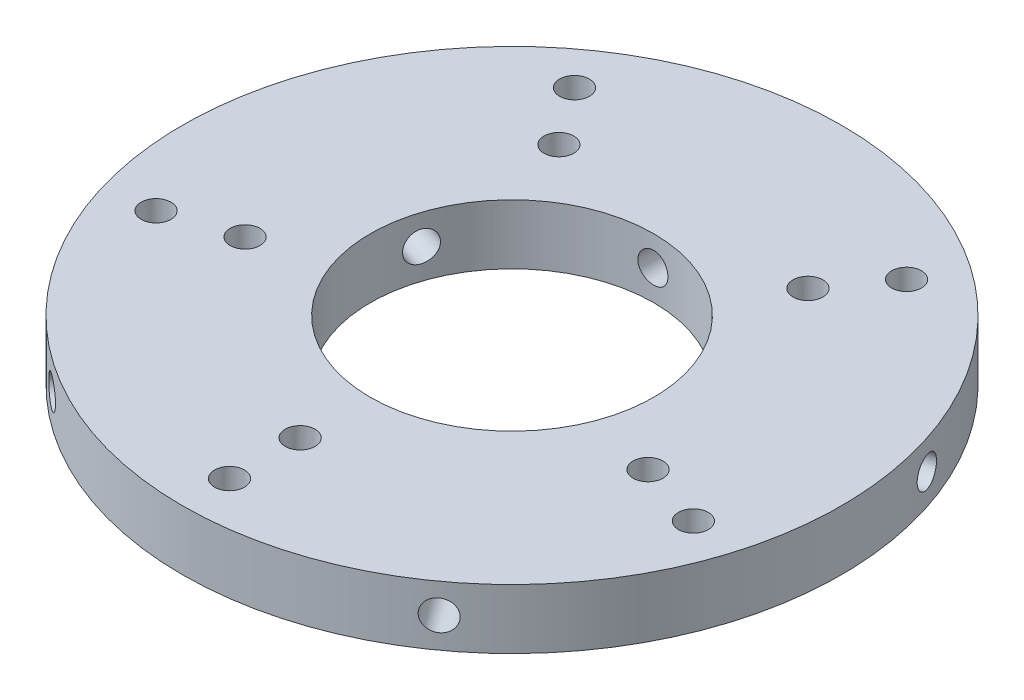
from build123d import *

# Parameters (mm, degrees)
CROQUIS1_R                 = 70
CROQUIS1_R_2               = 30.1
EXTRUIR1_DEPTH             = 12.7
CORTAR_EXTRUIR1_REACH      = 101.806
CORTAR_EXTRUIR1_END_RADIUS = 70
CROQUIS2_R                 = 3.2
MATRIZC1_COUNT             = 5
CORTAR_EXTRUIR2_REACH      = 101.806
CROQUIS4_R                 = 3.175
MATRIZC2_COUNT             = 5


with BuildPart() as part:
    # Croquis1 → Extruir1 (new body)
    with BuildSketch(Plane(origin=(0, 0, 0), x_dir=(1, 0, 0), z_dir=(0, 1, 0))):
        with Locations(Location((0, 0, 0), (0, 0, 270))):
            Circle(CROQUIS1_R)
        with Locations(Location((0, 0, 0), (0, 0, 270))):
            Circle(CROQUIS1_R_2, mode=Mode.SUBTRACT)
    extrude(amount=EXTRUIR1_DEPTH)

    # Cortar-Extruir1: up to this cylinder (the profile starts inside it)
    cortar_extruir1_end = Plane(origin=(0, 6.428835, 0), z_dir=(0, -1, 0)) * Cylinder(CORTAR_EXTRUIR1_END_RADIUS, 344.612, mode=Mode.PRIVATE)
    # Croquis2 → Cortar-Extruir1 (cut, up to the surface)
    with BuildSketch(Plane.XY, mode=Mode.PRIVATE) as cortar_extruir1_sk1:
        with Locations((0, 6.428835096)):
            Circle(CROQUIS2_R)
    cortar_extruir1_tool1 = extrude(cortar_extruir1_sk1.sketch, amount=-CORTAR_EXTRUIR1_REACH, mode=Mode.PRIVATE) & cortar_extruir1_end
    cortar_extruir1 = cortar_extruir1_tool1.solids().sort_by_distance((0, 6.428835, 0))[0]
    add(cortar_extruir1, mode=Mode.SUBTRACT)

    # MatrizC1: Cortar-Extruir1 ×5 about axis
    matrizc1_axis = Axis((0, 13.54995958, 0), (0, -1, 0))
    for i in range(1, MATRIZC1_COUNT):
        add(cortar_extruir1.rotate(matrizc1_axis, i * 360 / MATRIZC1_COUNT), mode=Mode.SUBTRACT)

    # Croquis4 → Cortar-Extruir2 (cut, up to next)
    with BuildSketch(Plane(origin=(0, 12.7, 0), x_dir=(-1, 0, 0), z_dir=(0, 1, 0)), mode=Mode.PRIVATE) as cortar_extruir2_sk1:
        with Locations(Location((0, 60, 0), (0, 0, 90))):
            Circle(CROQUIS4_R)
    cortar_extruir2_tool1 = extrude(cortar_extruir2_sk1.sketch, amount=-CORTAR_EXTRUIR2_REACH, mode=Mode.PRIVATE) & part.part
    # Croquis4 → Cortar-Extruir2 (cut, up to next)
    with BuildSketch(Plane(origin=(0, 12.7, 0), x_dir=(-1, 0, 0), z_dir=(0, 1, 0)), mode=Mode.PRIVATE) as cortar_extruir2_sk2:
        with Locations(Location((0, 45, 0), (0, 0, 90))):
            Circle(CROQUIS4_R)
    cortar_extruir2_tool2 = extrude(cortar_extruir2_sk2.sketch, amount=-CORTAR_EXTRUIR2_REACH, mode=Mode.PRIVATE) & part.part
    cortar_extruir2_1 = cortar_extruir2_tool1.solids().sort_by_distance((0, 12.7, 60))[0]
    add(cortar_extruir2_1, mode=Mode.SUBTRACT)
    cortar_extruir2_2 = cortar_extruir2_tool2.solids().sort_by_distance((0, 12.7, 45))[0]
    add(cortar_extruir2_2, mode=Mode.SUBTRACT)
    cortar_extruir2 = cortar_extruir2_1 + cortar_extruir2_2  # Cortar-Extruir2 as one shape, for the pattern or mirror that repeats it

    # MatrizC2: Cortar-Extruir2 ×5 about axis
    matrizc2_axis = Axis((0, 0, 0), (0, 1, 0))
    for i in range(1, MATRIZC2_COUNT):
        add(cortar_extruir2.rotate(matrizc2_axis, i * 360 / MATRIZC2_COUNT), mode=Mode.SUBTRACT)


solid = part.part
